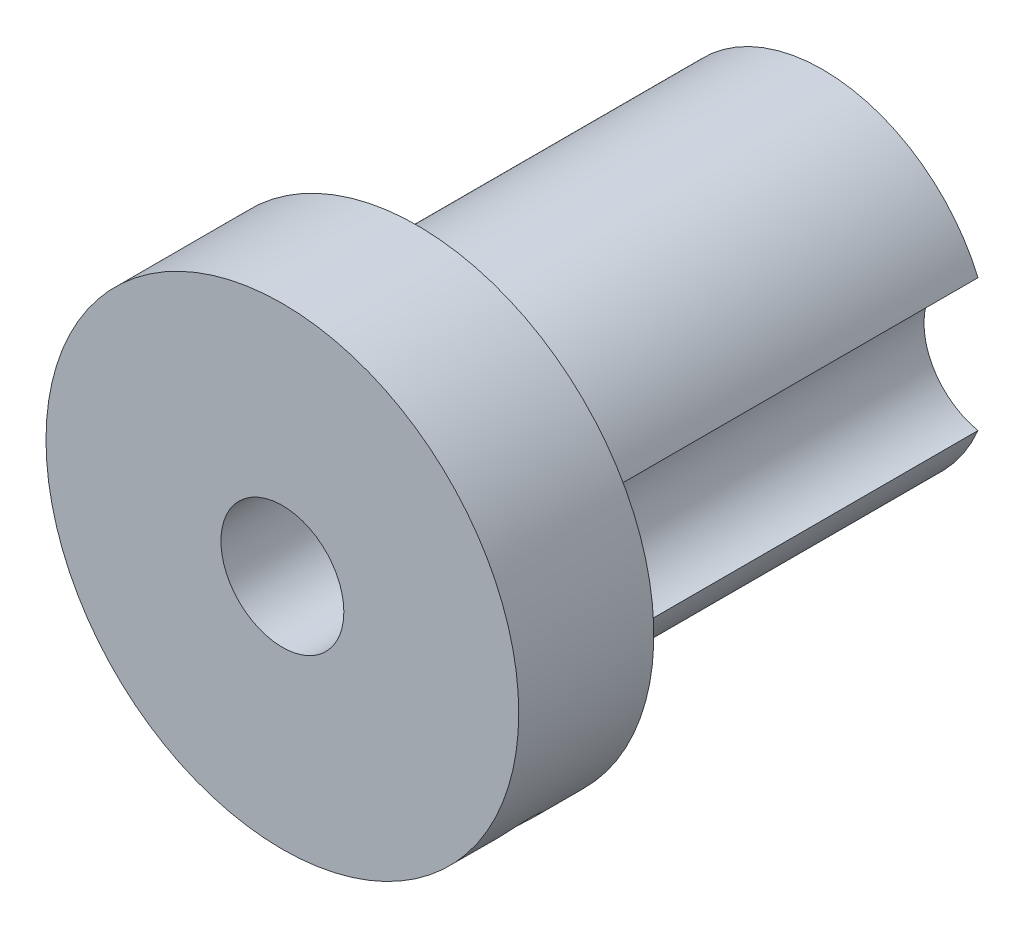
from build123d import *

# Parameters (mm, degrees)
SKETCH_1_R               = 35
SKETCH_1_R_2             = 9.1
EXTRUDE_1_DEPTH          = 80
SKETCH_2_OUTSIDE_W       = 97.456
SKETCH_2_OUTSIDE_H       = 97.456
SKETCH_2_OUTSIDE_R       = 25
CUT_EXTRUDE_1_DEPTH      = 60
SKETCH_3_R               = 1.65
CUT_EXTRUDE_2_DEPTH      = 15
CUT_EXTRUDE_3_DEPTH      = 78.781745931
CUT_EXTRUDE_4_REACH      = 118.361
CUT_EXTRUDE_4_END_RADIUS = 9.1
SKETCH_5_R               = 3


with BuildPart() as part:
    # Sketch 1 → Extrude 1 (new body)
    with BuildSketch(Plane.XY):
        Circle(SKETCH_1_R)
        Circle(SKETCH_1_R_2, mode=Mode.SUBTRACT)
    extrude(amount=EXTRUDE_1_DEPTH)

    # Sketch 2 outside → Cut-Extrude 1 (cut)
    with BuildSketch(Plane(origin=(0, 0, 0), x_dir=(-1, 0, 0), z_dir=(0, 0, -1))):
        Rectangle(SKETCH_2_OUTSIDE_W, SKETCH_2_OUTSIDE_H)
        Circle(SKETCH_2_OUTSIDE_R, mode=Mode.SUBTRACT)
    extrude(amount=-CUT_EXTRUDE_1_DEPTH, mode=Mode.SUBTRACT)

    # Sketch 3 → Cut-Extrude 2 (cut)
    with BuildSketch(Plane(origin=(0, 0, 60), x_dir=(-1, 0, 0), z_dir=(0, 0, -1))):
        with Locations((0, 30)):
            Circle(SKETCH_3_R)
        with Locations((30, 0)):
            Circle(SKETCH_3_R)
        with Locations((0, -30)):
            Circle(SKETCH_3_R)
        with Locations((-30, 0)):
            Circle(SKETCH_3_R)
    extrude(amount=-CUT_EXTRUDE_2_DEPTH, mode=Mode.SUBTRACT)

    # Sketch 4 → Cut-Extrude 3 (cut, through all)
    with BuildSketch(Plane(origin=(0, 0, 60), x_dir=(-1, 0, 0), z_dir=(0, 0, -1))):
        with BuildLine():
            ThreePointArc((-23, -9.797958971), (-15, 0), (-23, 9.797958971))
            ThreePointArc((-23, 9.797958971), (-25, 0), (-23, -9.797958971))
        make_face()
        with BuildLine():
            ThreePointArc((23, 9.797958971), (15, 0), (23, -9.797958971))
            ThreePointArc((23, -9.797958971), (25, 0), (23, 9.797958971))
        make_face()
    extrude(amount=CUT_EXTRUDE_3_DEPTH, mode=Mode.SUBTRACT)

    # Cut-Extrude 4: up to this cylinder (the profile starts outside it)
    cut_extrude_4_end = Plane(origin=(0, 0, 70), z_dir=(0, 0, -1)) * Cylinder(CUT_EXTRUDE_4_END_RADIUS, 255.922, mode=Mode.PRIVATE)
    # Sketch 5 → Cut-Extrude 4 (cut, up to the surface)
    with BuildSketch(Plane(origin=(24.748737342, -24.748737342, 0), x_dir=(0, 0, -1), z_dir=(0.7071067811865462, -0.7071067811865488, 0)), mode=Mode.PRIVATE) as cut_extrude_4_sk1:
        with Locations(Location((-70, 0, 0), (0, 0, 90))):
            Circle(SKETCH_5_R)
    cut_extrude_4_tool1 = extrude(cut_extrude_4_sk1.sketch, amount=-CUT_EXTRUDE_4_REACH, mode=Mode.PRIVATE) - cut_extrude_4_end
    add(cut_extrude_4_tool1.solids().sort_by_distance((24.748737, -24.748737, 70))[0], mode=Mode.SUBTRACT)


solid = part.part
